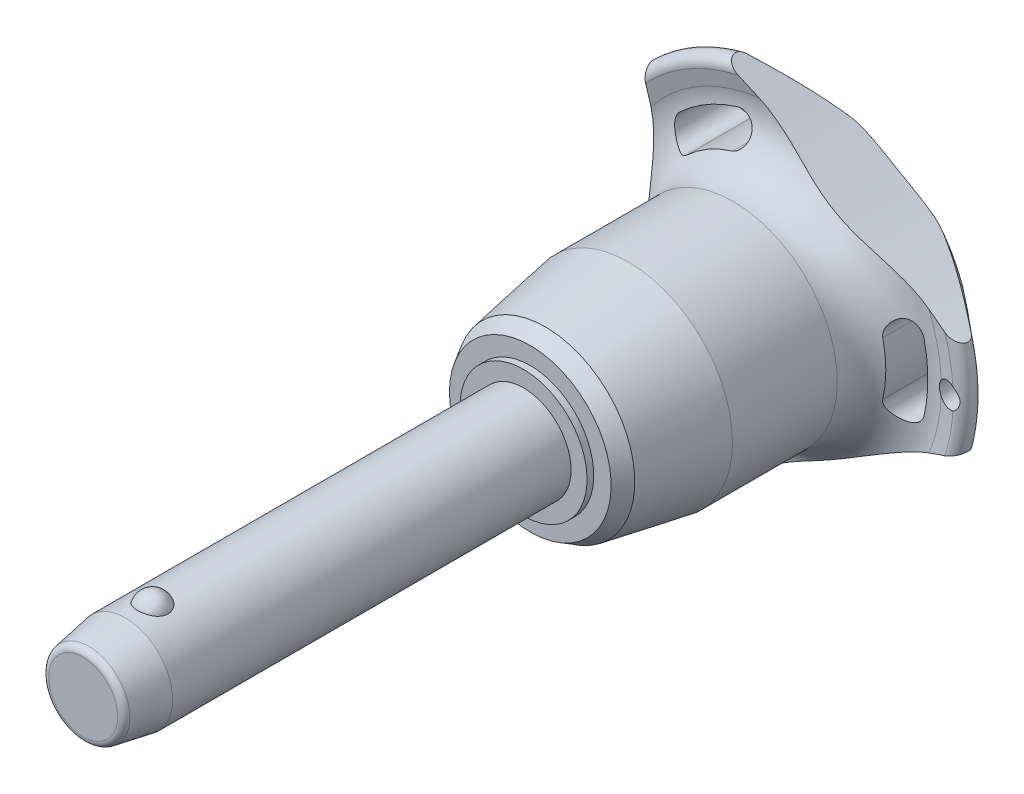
from build123d import *

# Parameters (mm, degrees)
SKETCH1_R           = 6
BOSS_EXTRUDE1_DEPTH = 45
SKETCH2_R           = 5.15
BOSS_EXTRUDE2_DEPTH = 39.7
BOSS_EXTRUDE3_START = 10.6
SKETCH1_2_R         = 6
BOSS_EXTRUDE3_DEPTH = 10.6
CHAMFER1_SIZE       = 5.3
CHAMFER1_SIZE2      = 0.934532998
FILLET1_R           = 0.85
SKETCH6_R           = 144.275
CUT_EXTRUDE1_DEPTH  = 92.145351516
CIRPATTERN1_COUNT   = 3
SKETCH7_R           = 1.5
CUT_EXTRUDE2_DEPTH  = 91.924898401


with BuildPart() as part:
    # Sketch1 → Boss-Extrude1 (new body)
    with BuildSketch(Plane.XY):
        Circle(SKETCH1_R)
    extrude(amount=-BOSS_EXTRUDE1_DEPTH)

    # Sketch2 → Boss-Extrude2 (add)
    with BuildSketch(Plane(origin=(0, 0, -45), x_dir=(-1, 0, 0), z_dir=(0, 0, -1))):
        Circle(SKETCH2_R)
    extrude(amount=BOSS_EXTRUDE2_DEPTH)

    # Sketch3 → Revolve1 (revolve)
    with BuildSketch(Plane(origin=(0, 0, 0), x_dir=(0, 0, -1), z_dir=(1, 0, 0))):
        with BuildLine():
            Line((-1.854049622, 7.25), (-1.854049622, 3.25))
            ThreePointArc((-1.854049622, 3.25), (0.145950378, 5.25), (-1.854049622, 7.25))
        make_face()
        with BuildLine():
            Line((-1.854049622, -3.25), (-1.854049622, -7.25))
            ThreePointArc((-1.854049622, -7.25), (0.145950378, -5.25), (-1.854049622, -3.25))
        make_face()
    revolve(axis=Axis((0, -3.25, 1.854049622), (0, 1, 0)))

    # Sketch1_2 → Boss-Extrude3 (add)
    with BuildSketch(Plane.XY.offset(BOSS_EXTRUDE3_START)):
        Circle(SKETCH1_2_R)
    extrude(amount=-BOSS_EXTRUDE3_DEPTH)

    # Chamfer1
    chamfer1_edges = [part.edges().sort_by_distance(p)[0] for p in [
        (-6, 0, 10.6),
    ]]
    chamfer1_side = [part.faces().sort_by_distance(p)[0] for p in [
        (-6, 0, -17.2),
    ]]
    chamfer(chamfer1_edges, length=CHAMFER1_SIZE, length2=CHAMFER1_SIZE2, reference=chamfer1_side[0])

    # Fillet1
    fillet1_edges = [part.edges().sort_by_distance(p)[0] for p in [
        (-5.065467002, 0, 10.6),
        (5.15, 0, -84.7),
    ]]
    fillet(fillet1_edges, radius=FILLET1_R)

    # Sketch4 → Revolve2 (revolve)
    with BuildSketch(Plane(origin=(0, 0, 0), x_dir=(0, 0, -1), z_dir=(1, 0, 0)), mode=Mode.PRIVATE) as revolve2_sk:
        Polygon((45, 0), (45, 8.017240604), (45.85, 8.017240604), (45.85, 10.206249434), (47.745737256, 11.300753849), (58.233333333, 13.15), (71.466666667, 13.15), (71.466666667, 0), align=None)
    revolve(revolve2_sk.sketch.rotate(Axis((0, 0, -71.466666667), (0, 0, 1)), 90), axis=Axis((0, 0, -71.466666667), (0, 0, 1)))

    # Sketch5 → Revolve3 (revolve)
    with BuildSketch(Plane(origin=(0, 0, 0), x_dir=(0, 0, -1), z_dir=(1, 0, 0)), mode=Mode.PRIVATE) as revolve3_sk:
        with BuildLine():
            Line((77.32877039, 20.428960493), (76.910912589, 22.344207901))
            ThreePointArc((76.910912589, 22.344207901), (77.554394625, 23.677136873), (79.002586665, 23.371345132))
            Line((79.002586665, 23.371345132), (84.141488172, 17.247040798))
            ThreePointArc((84.141488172, 17.247040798), (84.7, 15.584758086), (83.978803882, 13.986322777))
            ThreePointArc((83.978803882, 13.986322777), (79.617427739, 7.589034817), (78.083333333, 0))
            Line((78.083333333, 0), (71.466666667, 0))
            Line((71.466666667, 0), (71.466666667, 13.15))
            ThreePointArc((71.466666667, 13.15), (76.139661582, 15.38660811), (77.32877039, 20.428960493))
        make_face()
    revolve(revolve3_sk.sketch.rotate(Axis((0, 0, -78.083333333), (0, 0, 1)), 90), axis=Axis((0, 0, -78.083333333), (0, 0, 1)))

    # Sketch6 → Cut-Extrude1 (cut, through all)
    with BuildSketch(Plane.XY):
        with Locations((-159.975, 0)):
            Circle(SKETCH6_R)
        with BuildLine():
            ThreePointArc((18.131206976, -4.190753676), (18.60922037, 0), (18.131206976, 4.190753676))
            ThreePointArc((18.131206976, 4.190753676), (15.94840906, 5.553949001), (14.585213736, 3.371151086))
            ThreePointArc((14.585213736, 3.371151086), (14.969740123, 0), (14.585213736, -3.371151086))
            ThreePointArc((14.585213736, -3.371151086), (15.94840906, -5.553949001), (18.131206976, -4.190753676))
        make_face()
    cut_extrude1 = extrude(amount=-CUT_EXTRUDE1_DEPTH, mode=Mode.SUBTRACT)

    # CirPattern1: Cut-Extrude1 ×3 about axis
    cirpattern1_axis = Axis((0, 0, 0), (0, 0, 1))
    for i in range(1, CIRPATTERN1_COUNT):
        add(cut_extrude1.rotate(cirpattern1_axis, i * 360 / CIRPATTERN1_COUNT), mode=Mode.SUBTRACT)

    # Sketch7 → Cut-Extrude2 (cut, through all)
    with BuildSketch(Plane.XY):
        with Locations(Location((21.60922037, 0, 0), (0, 0, 297.620773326))):
            Circle(SKETCH7_R)
    extrude(amount=-CUT_EXTRUDE2_DEPTH, mode=Mode.SUBTRACT)


solid = part.part
